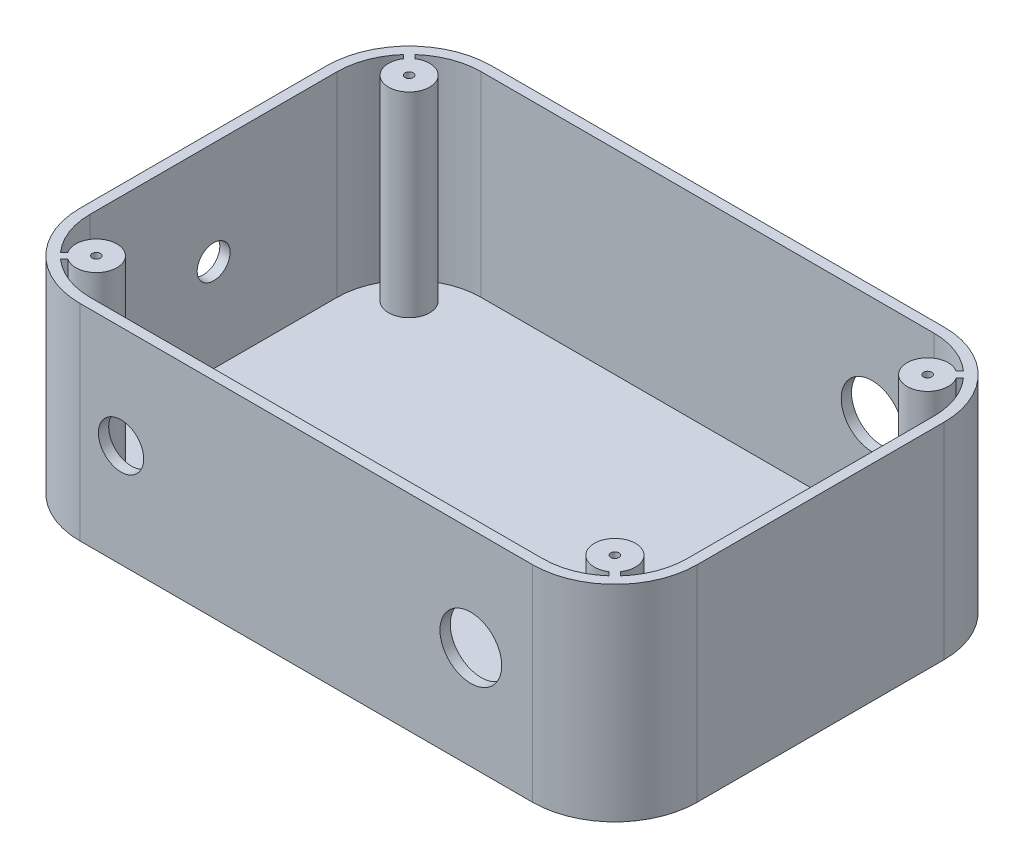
from build123d import *

# Parameters (mm, degrees)
SKETCH1_W               = 150
SKETCH1_H               = 100
BOSS_EXTRUDE1_DEPTH     = 50
FILLET1_R               = 20
SHELL1_T                = -2.5
BOSS_EXTRUDE2_START     = -50
BOSS_EXTRUDE2_DEPTH     = 50
SKETCH6_R               = 1
CUT_EXTRUDE3_DEPTH      = 46
MIRROR2_START           = -50
MIRROR2_COPY_1_DEPTH    = 50
MIRROR2_COPY_2_SKETCH_R = 1
MIRROR2_COPY_2_DEPTH    = 46
SKETCH7_R               = 7.5
CUT_EXTRUDE4_DEPTH      = 135.629120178
SKETCH8_R               = 5.5
CUT_EXTRUDE5_DEPTH      = 46
SKETCH9_R               = 4
CUT_EXTRUDE6_DEPTH      = 46


with BuildPart() as part:
    # Sketch1 → Boss-Extrude1 (new body)
    with BuildSketch(Plane(origin=(0, 0, 0), x_dir=(1, 0, 0), z_dir=(0, 1, 0))):
        Rectangle(SKETCH1_W, SKETCH1_H)
    extrude(amount=BOSS_EXTRUDE1_DEPTH)

    # Fillet1
    fillet1_edges = [part.edges().sort_by_distance(p)[0] for p in [
        (75, 25, 50),
        (-75, 25, 50),
        (-75, 25, -50),
        (75, 25, -50),
    ]]
    fillet(fillet1_edges, radius=FILLET1_R)

    # Shell1
    shell1_openings = [part.faces().sort_by_distance(p)[0] for p in [
        (0, 50, 0),
    ]]
    offset(amount=SHELL1_T, openings=shell1_openings, kind=Kind.INTERSECTION)

    # Sketch2 → Boss-Extrude2 (add)
    with BuildSketch(Plane.XZ.offset(BOSS_EXTRUDE2_START)):
        with BuildLine():
            Line((-69.831553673, 43.417340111), (-67.171208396, 40.756994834))
            ThreePointArc((-67.171208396, 40.756994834), (-59.464466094, 34.464466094), (-65.756994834, 42.171208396))
            Line((-65.756994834, 42.171208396), (-68.417340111, 44.831553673))
            ThreePointArc((-68.417340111, 44.831553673), (-69.142135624, 44.142135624), (-69.831553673, 43.417340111))
        make_face()
    boss_extrude2 = extrude(amount=BOSS_EXTRUDE2_DEPTH)

    # Sketch6 → Cut-Extrude3 (cut)
    with BuildSketch(Plane(origin=(0, 50, 0), x_dir=(1, 0, 0), z_dir=(0, 1, 0))):
        with Locations(Location((-63, -38, 0), (0, 0, 270))):
            Circle(SKETCH6_R)
    cut_extrude3 = extrude(amount=-CUT_EXTRUDE3_DEPTH, mode=Mode.SUBTRACT)

    # Mirror1: Boss-Extrude2, Cut-Extrude3 across plane
    add(boss_extrude2.mirror(Plane.XY))
    add(cut_extrude3.mirror(Plane.XY), mode=Mode.SUBTRACT)

    # Mirror2: Boss-Extrude2, Cut-Extrude3 across plane
    add(boss_extrude2.mirror(Plane(origin=(0, 0, 0), x_dir=(0, 0, 1), z_dir=(1, 0, 0))))
    add(cut_extrude3.mirror(Plane(origin=(0, 0, 0), x_dir=(0, 0, 1), z_dir=(1, 0, 0))), mode=Mode.SUBTRACT)

    # Mirror2 copy 1 sketch → Mirror2 copy 1 (add)
    with BuildSketch(Plane(origin=(0, 0, 0), x_dir=(-1, 0, 0), z_dir=(0, -1, 0)).offset(MIRROR2_START)):
        with BuildLine():
            Line((-69.831553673, 43.417340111), (-67.171208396, 40.756994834))
            ThreePointArc((-67.171208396, 40.756994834), (-59.464466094, 34.464466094), (-65.756994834, 42.171208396))
            Line((-65.756994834, 42.171208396), (-68.417340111, 44.831553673))
            ThreePointArc((-68.417340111, 44.831553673), (-69.142135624, 44.142135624), (-69.831553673, 43.417340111))
        make_face()
    extrude(amount=MIRROR2_COPY_1_DEPTH)

    # Mirror2 copy 2 sketch → Mirror2 copy 2 (cut)
    with BuildSketch(Plane(origin=(0, 50, 0), x_dir=(-1, 0, 0), z_dir=(0, 1, 0))):
        with Locations(Location((-63, -38, 0), (0, 0, 270))):
            Circle(MIRROR2_COPY_2_SKETCH_R)
    extrude(amount=-MIRROR2_COPY_2_DEPTH, mode=Mode.SUBTRACT)

    # Sketch7 → Cut-Extrude4 (cut, through all)
    with BuildSketch(Plane(origin=(0, 0, -50), x_dir=(-1, 0, 0), z_dir=(0, 0, -1))):
        with Locations((-40, 25)):
            Circle(SKETCH7_R)
    extrude(amount=-CUT_EXTRUDE4_DEPTH, mode=Mode.SUBTRACT)

    # Sketch8 → Cut-Extrude5 (cut)
    with BuildSketch(Plane.XY.offset(50)):
        with Locations((-45, 25)):
            Circle(SKETCH8_R)
    extrude(amount=-CUT_EXTRUDE5_DEPTH, mode=Mode.SUBTRACT)

    # Sketch9 → Cut-Extrude6 (cut)
    with BuildSketch(Plane.ZY.offset(75)):
        with Locations((0, 25)):
            Circle(SKETCH9_R)
    extrude(amount=-CUT_EXTRUDE6_DEPTH, mode=Mode.SUBTRACT)


solid = part.part
